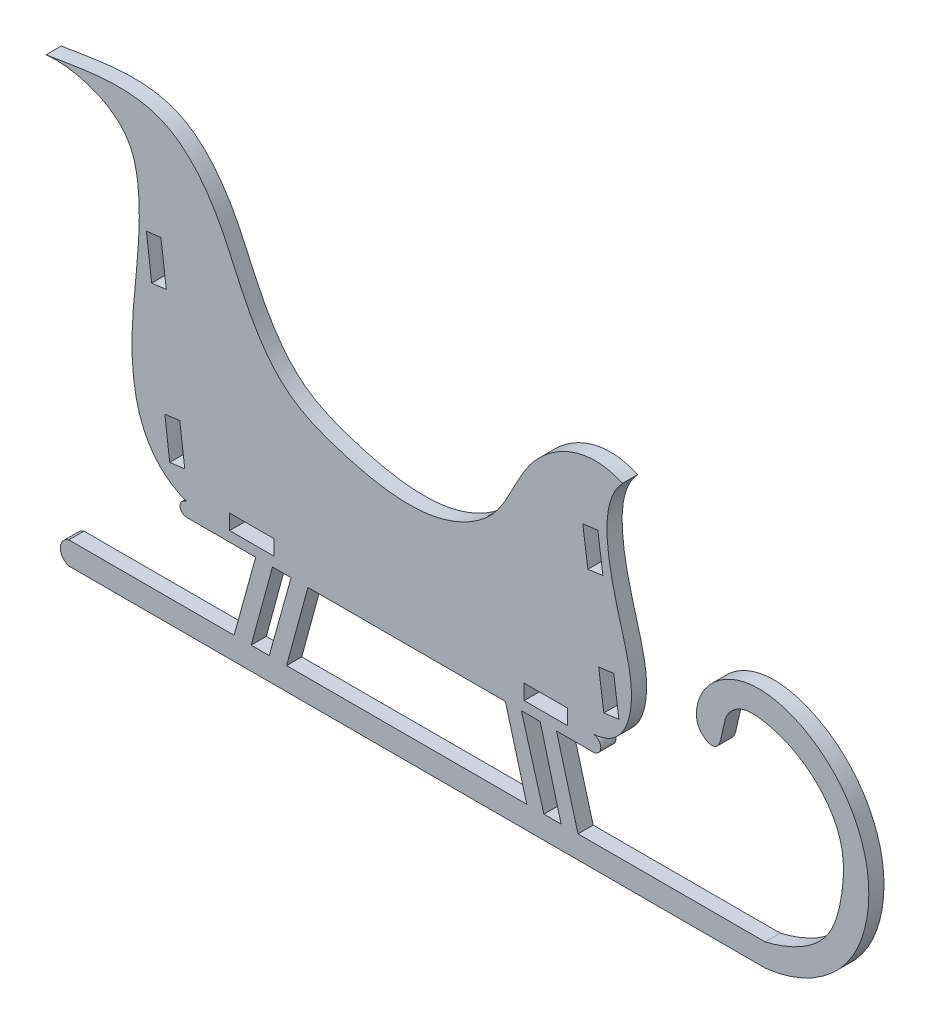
from build123d import *

# Parameters (mm, degrees)
BOSS_EXTRU_1_DEPTH      = 3
ESQUISSE2_W             = 8.728363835
ESQUISSE2_H             = 3
ESQUISSE2_W_2           = 8.623586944
ENL_V_MAT_EXTRU_3_DEPTH = 3


with BuildPart() as part:
    # Esquisse1 → Boss.-Extru.1 (new body)
    with BuildSketch(Plane.XY):
        with BuildLine():
            Line((-84.179780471, -61.030383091), (53.647217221, -61.030383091))
            add(Edge.make_bspline(
                [(53.647217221, -56.546461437), (58.053357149, -55.504680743), (66.234614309, -51.843470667), (69.149367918, -40.899137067), (69.554288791, -31.213460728), (63.359064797, -22.549205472), (55.549827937, -18.828347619), (48.855346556, -18.359931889), (45.475828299, -21.674545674), (45.399935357, -24.938924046), (44.003232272, -28.956545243), (40.243038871, -27.027520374), (39.731783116, -22.505493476), (42.682812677, -16.757562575), (50.990012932, -12.59933432), (61.433508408, -15.239419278), (69.753295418, -22.46343367), (74.311710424, -32.338000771), (74.417819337, -42.825459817), (69.382362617, -55.383789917), (59.929194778, -60.433644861), (53.647217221, -61.030383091)],
                knots=[0, 0, 0, 0, 0.088775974, 0.14400049, 0.202223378, 0.264386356, 0.328354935, 0.361062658, 0.380199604, 0.408186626, 0.42471597, 0.443517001, 0.464072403, 0.504919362, 0.555747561, 0.624981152, 0.691371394, 0.756103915, 0.82130312, 0.881681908, 1, 1, 1, 1], degree=3))
            Line((53.647217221, -56.546461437), (16.619278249, -56.546461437))
            Line((16.619278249, -56.546461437), (12.355085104, -41.033603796))
            Line((12.355085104, -41.033603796), (19.580557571, -41.033603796))
            ThreePointArc((19.580557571, -41.033603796), (21.12658679, -39.487574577), (19.580557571, -37.941545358))
            add(Edge.make_bspline(
                [(25.441710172, 7.951094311), (22.420813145, 4.697393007), (21.724585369, -4.706848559), (25.149911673, -16.551872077), (28.477573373, -28.860609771), (25.229982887, -37.586878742), (19.580557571, -37.941545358)],
                knots=[0, 0, 0, 0, 0.248798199, 0.526226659, 0.732928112, 1, 1, 1, 1], degree=3))
            add(Edge.make_bspline(
                [(-88.685890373, 24.360351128), (-81.531647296, 25.434977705), (-67.542138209, 28.712549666), (-54.528993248, 15.178059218), (-50.000116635, 2.009379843), (-41.743246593, -10.487044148), (-27.43742735, -15.803264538), (-12.633947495, -18.394778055), (1.637521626, -10.574531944), (6.335557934, 4.88697208), (18.239474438, 11.179085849), (25.441710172, 7.951094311)],
                knots=[0, 0, 0, 0, 0.166304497, 0.245585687, 0.366515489, 0.460245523, 0.543161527, 0.677096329, 0.761826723, 0.854727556, 1, 1, 1, 1], degree=3))
            add(Edge.make_bspline(
                [(-88.685890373, 24.360351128), (-83.396842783, 24.956315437), (-71.917421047, 21.837068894), (-69.171062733, 3.386280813), (-73.396023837, -15.596063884), (-70.048620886, -34.797668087), (-60.820134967, -38.354635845)],
                knots=[0, 0, 0, 0, 0.22694679, 0.34456348, 0.666346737, 1, 1, 1, 1], degree=3))
            ThreePointArc((-60.820134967, -38.354635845), (-62.159618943, -39.694119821), (-60.820134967, -41.033603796))
            Line((-60.820134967, -41.033603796), (-47.185891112, -41.033603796))
            Line((-47.185891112, -41.033603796), (-51.462295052, -56.546461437))
            Line((-51.462295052, -56.546461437), (-84.179780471, -56.546461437))
            ThreePointArc((-84.179780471, -56.546461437), (-85.856403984, -58.788422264), (-84.179780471, -61.030383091))
        make_face()
        Polygon((-43.854274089, -41.033603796), (-48.080952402, -56.546461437), (-44.500707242, -56.546461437), (-40.174577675, -41.033603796), align=None, mode=Mode.SUBTRACT)
        Polygon((-36.842960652, -41.033603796), (-41.069638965, -56.546461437), (6.479228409, -56.546461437), (2.248611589, -41.033603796), align=None, mode=Mode.SUBTRACT)
        Polygon((5.404786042, -41.033603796), (9.870437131, -56.546461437), (13.261645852, -56.546461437), (9.131758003, -41.033603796), align=None, mode=Mode.SUBTRACT)
    extrude(amount=BOSS_EXTRU_1_DEPTH)

    # Esquisse2 → Enl_v. mat.-Extru.3 (cut)
    with BuildSketch(Plane.XY):
        Polygon((20.539304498, -2.519765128), (21.539789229, -9.810797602), (18.567641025, -10.218639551), (17.567156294, -2.927607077), align=None)
        with Locations((-47.969018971, -37.537055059)):
            Rectangle(ESQUISSE2_W, ESQUISSE2_H)
        with Locations((10.272461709, -37.537055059)):
            Rectangle(ESQUISSE2_W_2, ESQUISSE2_H)
        Polygon((21.731411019, -33.274613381), (24.703559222, -32.866771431), (23.69123247, -25.489440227), (20.719084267, -25.897282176), align=None)
        Polygon((-68.811015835, 4.066502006), (-67.77470543, -4.332798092), (-64.878276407, -3.975435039), (-65.938092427, 4.420964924), align=None)
        Polygon((-64.203847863, -33.274613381), (-61.226424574, -32.907257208), (-62.209794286, -25.116503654), (-65.164386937, -25.489440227), align=None)
    extrude(amount=ENL_V_MAT_EXTRU_3_DEPTH, mode=Mode.SUBTRACT)


solid = part.part
